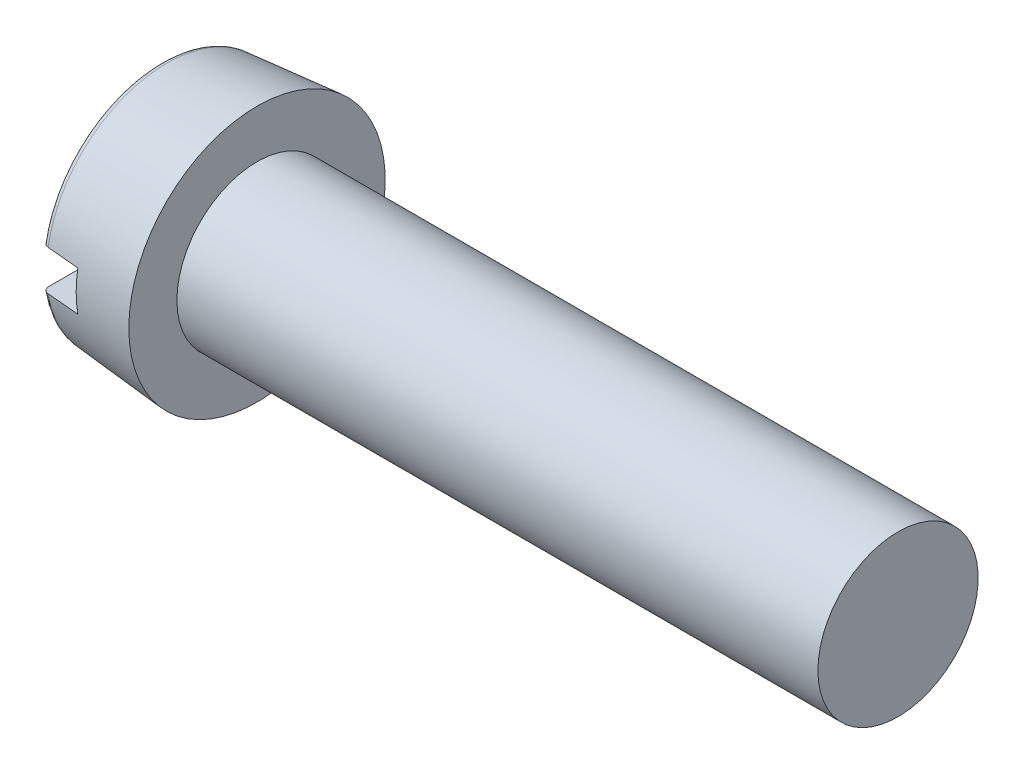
from build123d import *

# Parameters (mm, degrees)
FILLET2_R  = 0.4
SKETCH2_W  = 16
SKETCH2_H  = 2.5
SLOT_DEPTH = 2.4


with BuildPart() as part:
    # BodySke → Base-Revolve (revolve)
    with BuildSketch(Plane.XY, mode=Mode.PRIVATE) as base_revolve_sk:
        Polygon((6, 5), (6, 8), (0, 7.475068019), (0, 0), (46, 0), (46, 5), align=None)
    revolve(base_revolve_sk.sketch.rotate(Axis((-25.4, 0, 0), (1, 0, 0)), 90), axis=Axis((-25.4, 0, 0), (1, 0, 0)))

    # Fillet2
    fillet2_edges = [part.edges().sort_by_distance(p)[0] for p in [
        (0, 0, -7.475068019),
    ]]
    fillet(fillet2_edges, radius=FILLET2_R)

    # Sketch2 → Slot (cut)
    with BuildSketch(Plane(origin=(0, 0, 0), x_dir=(0, 0, -1), z_dir=(1, 0, 0))):
        Rectangle(SKETCH2_W, SKETCH2_H)
    extrude(amount=SLOT_DEPTH, mode=Mode.SUBTRACT)


solid = part.part
